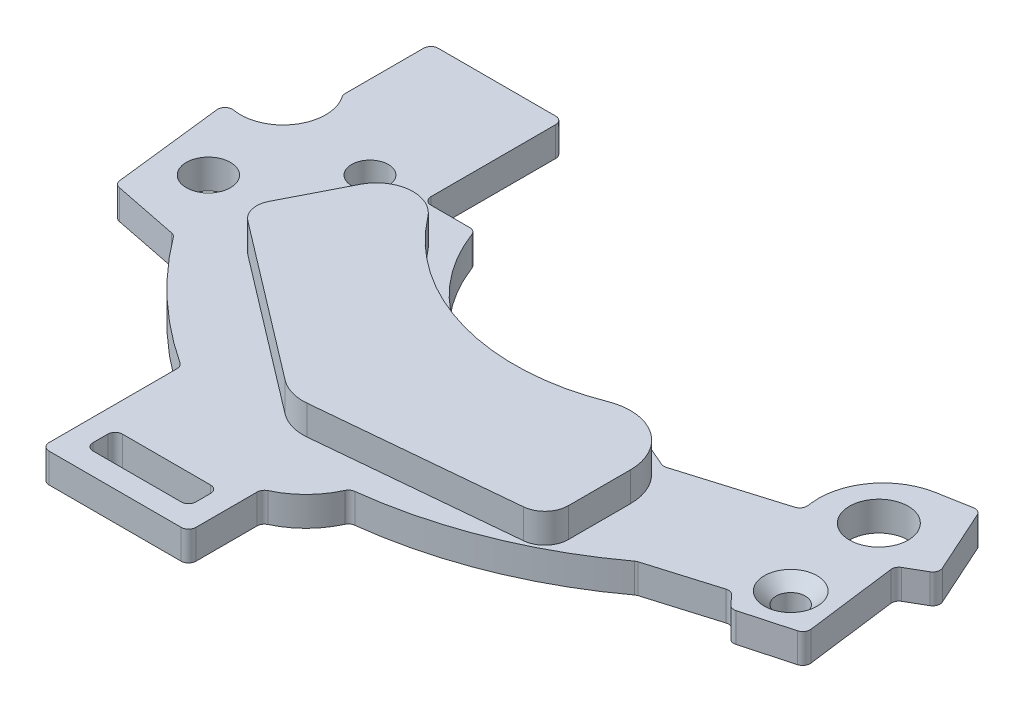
from build123d import *

# Parameters (mm, degrees)
BOSS_EXTRUDE1_DEPTH = 2
BOSS_EXTRUDE2_DEPTH = 2
SKETCH3_R           = 2
SKETCH3_R_2         = 1.5
SKETCH3_R_3         = 1
SKETCH3_R_4         = 1.25
CUT_EXTRUDE1_DEPTH  = 2
CHAMFER1_SIZE       = 0.8


with BuildPart() as part:
    # Sketch1 → Boss-Extrude1 (new body)
    with BuildSketch(Plane(origin=(0, 0, 0), x_dir=(1, 0, 0), z_dir=(0, 1, 0))):
        with BuildLine():
            Line((-52, 42), (-44, 42))
            ThreePointArc((-44, 42), (-43.646446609, 41.853553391), (-43.5, 41.5))
            Line((-43.5, 41.5), (-43.5, 33))
            ThreePointArc((-43.5, 33), (-43.353553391, 32.646446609), (-43, 32.5))
            Line((-43, 32.5), (-40.351233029, 32.5))
            ThreePointArc((-40.351233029, 32.5), (-40.066668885, 32.411124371), (-39.883268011, 32.176092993))
            ThreePointArc((-39.883268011, 32.176092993), (-32.822367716, 25.045001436), (-22.799911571, 25.554071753))
            ThreePointArc((-22.799911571, 25.554071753), (-21.952987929, 25.77117524), (-21.094376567, 25.606250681))
            Line((-21.094376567, 25.606250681), (-19.868116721, 25.073094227))
            ThreePointArc((-19.868116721, 25.073094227), (-19.698090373, 25.032490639), (-19.524478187, 25.052896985))
            Line((-19.524478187, 25.052896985), (-12.804229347, 27.078177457))
            ThreePointArc((-12.804229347, 27.078177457), (-12.529416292, 27.284210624), (-12.452365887, 27.618927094))
            Line((-12.452365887, 27.618927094), (-12.482364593, 27.858916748))
            ThreePointArc((-12.482364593, 27.858916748), (-11.65968031, 31.013261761), (-8.892057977, 32.73575081))
            Line((-8.892057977, 32.73575081), (-6.683693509, 33.131278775))
            ThreePointArc((-6.683693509, 33.131278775), (-6.362461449, 33.081459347), (-6.13975058, 32.84466433))
            Line((-6.13975058, 32.84466433), (-4.185751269, 28.511883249))
            ThreePointArc((-4.185751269, 28.511883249), (-4.165556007, 28.153245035), (-4.391026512, 27.87361623))
            Line((-4.391026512, 27.87361623), (-5.612191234, 27.166626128))
            ThreePointArc((-5.612191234, 27.166626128), (-5.809906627, 26.95546818), (-5.857590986, 26.670152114))
            Line((-5.857590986, 26.670152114), (-5.055377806, 20.430716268))
            ThreePointArc((-5.055377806, 20.430716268), (-5.135070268, 20.089905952), (-5.418717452, 19.884852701))
            Line((-5.418717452, 19.884852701), (-8.703973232, 18.981407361))
            ThreePointArc((-8.703973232, 18.981407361), (-8.97583776, 18.983302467), (-9.20652151, 19.127173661))
            Line((-9.20652151, 19.127173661), (-9.7880929, 19.76690219))
            ThreePointArc((-9.7880929, 19.76690219), (-10.024329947, 19.912349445), (-10.30173688, 19.909478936))
            Line((-10.30173688, 19.909478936), (-14.915948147, 18.525215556))
            ThreePointArc((-14.915948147, 18.525215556), (-14.996233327, 18.493339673), (-15.06983397, 18.448121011))
            ThreePointArc((-15.06983397, 18.448121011), (-21.538307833, 14.849994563), (-28.713588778, 13.032575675))
            ThreePointArc((-28.713588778, 13.032575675), (-28.94907353, 12.940141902), (-29.109171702, 12.744270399))
            ThreePointArc((-29.109171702, 12.744270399), (-30.176921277, 11.202615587), (-31.711284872, 10.124414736))
            ThreePointArc((-31.711284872, 10.124414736), (-31.921688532, 9.939910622), (-32, 9.671249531))
            Line((-32, 9.671249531), (-32, 5.5))
            ThreePointArc((-32, 5.5), (-32.146446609, 5.146446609), (-32.5, 5))
            Line((-32.5, 5), (-41.5, 5))
            ThreePointArc((-41.5, 5), (-41.853553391, 5.146446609), (-42, 5.5))
            Line((-42, 5.5), (-42, 14.229003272))
            ThreePointArc((-42, 14.229003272), (-42.05989423, 14.466294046), (-42.225227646, 14.646735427))
            ThreePointArc((-42.225227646, 14.646735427), (-46.367251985, 17.915659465), (-49.886255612, 21.847433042))
            ThreePointArc((-49.886255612, 21.847433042), (-50.019647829, 21.970370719), (-50.188123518, 22.037624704))
            Line((-50.188123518, 22.037624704), (-54.643406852, 22.92868137))
            ThreePointArc((-54.643406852, 22.92868137), (-54.91303508, 23.080140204), (-55.042002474, 23.361221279))
            Line((-55.042002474, 23.361221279), (-55.911679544, 30.84044408))
            ThreePointArc((-55.911679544, 30.84044408), (-55.757107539, 31.262858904), (-55.32568638, 31.390148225))
            ThreePointArc((-55.32568638, 31.390148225), (-52.37477273, 32.664950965), (-52.412870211, 35.879225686))
            ThreePointArc((-52.412870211, 35.879225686), (-52.477721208, 36.013662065), (-52.5, 36.161250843))
            Line((-52.5, 36.161250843), (-52.5, 41.5))
            ThreePointArc((-52.5, 41.5), (-52.353553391, 41.853553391), (-52, 42))
        make_face()
    extrude(amount=BOSS_EXTRUDE1_DEPTH)

    # Sketch2 → Boss-Extrude2 (add)
    with BuildSketch(Plane(origin=(0, 2, 0), x_dir=(1, 0, 0), z_dir=(0, 1, 0))):
        with BuildLine():
            Line((-18.6, 21.686425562), (-18.6, 17.457860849))
            ThreePointArc((-18.6, 17.457860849), (-19.017316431, 16.380243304), (-20.051574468, 15.864760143))
            Line((-20.051574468, 15.864760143), (-33.53459065, 14.608578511))
            ThreePointArc((-33.53459065, 14.608578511), (-34.639327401, 14.711721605), (-35.631018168, 15.209347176))
            Line((-35.631018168, 15.209347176), (-46.303317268, 23.340622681))
            ThreePointArc((-46.303317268, 23.340622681), (-46.85684454, 24.200867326), (-46.730160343, 25.215935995))
            Line((-46.730160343, 25.215935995), (-44.629060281, 29.330590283))
            ThreePointArc((-44.629060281, 29.330590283), (-42.62589141, 30.683650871), (-40.413906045, 29.708674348))
            ThreePointArc((-40.413906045, 29.708674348), (-32.695535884, 24.470662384), (-23.37964334, 24.944110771))
            ThreePointArc((-23.37964334, 24.944110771), (-20.128801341, 24.57854863), (-18.6, 21.686425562))
        make_face()
    extrude(amount=BOSS_EXTRUDE2_DEPTH)

    # Sketch3 → Cut-Extrude1 (cut)
    with BuildSketch(Plane(origin=(0, 2, 0), x_dir=(1, 0, 0), z_dir=(0, 1, 0))):
        with Locations(Location((-9, 29, 0), (0, 0, 270))):
            Circle(SKETCH3_R)
        with Locations(Location((-52.35, 26.7, 0), (0, 0, 270))):
            Circle(SKETCH3_R_2)
        with Locations(Location((-8, 22, 0), (0, 0, 270))):
            Circle(SKETCH3_R_3)
        with Locations(Location((-46.85, 32.2, 0), (0, 0, 270))):
            Circle(SKETCH3_R_4)
        with BuildLine():
            Line((-40, 8.5), (-34, 8.5))
            ThreePointArc((-34, 8.5), (-33.646446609, 8.353553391), (-33.5, 8))
            Line((-33.5, 8), (-33.5, 7))
            ThreePointArc((-33.5, 7), (-33.646446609, 6.646446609), (-34, 6.5))
            Line((-34, 6.5), (-40, 6.5))
            ThreePointArc((-40, 6.5), (-40.353553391, 6.646446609), (-40.5, 7))
            Line((-40.5, 7), (-40.5, 8))
            ThreePointArc((-40.5, 8), (-40.353553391, 8.353553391), (-40, 8.5))
        make_face()
    extrude(amount=-CUT_EXTRUDE1_DEPTH, mode=Mode.SUBTRACT)

    # Chamfer1
    chamfer1_edges = [part.edges().sort_by_distance(p)[0] for p in [
        (-8, 2, -23),
    ]]
    chamfer(chamfer1_edges, length=CHAMFER1_SIZE)


solid = part.part
